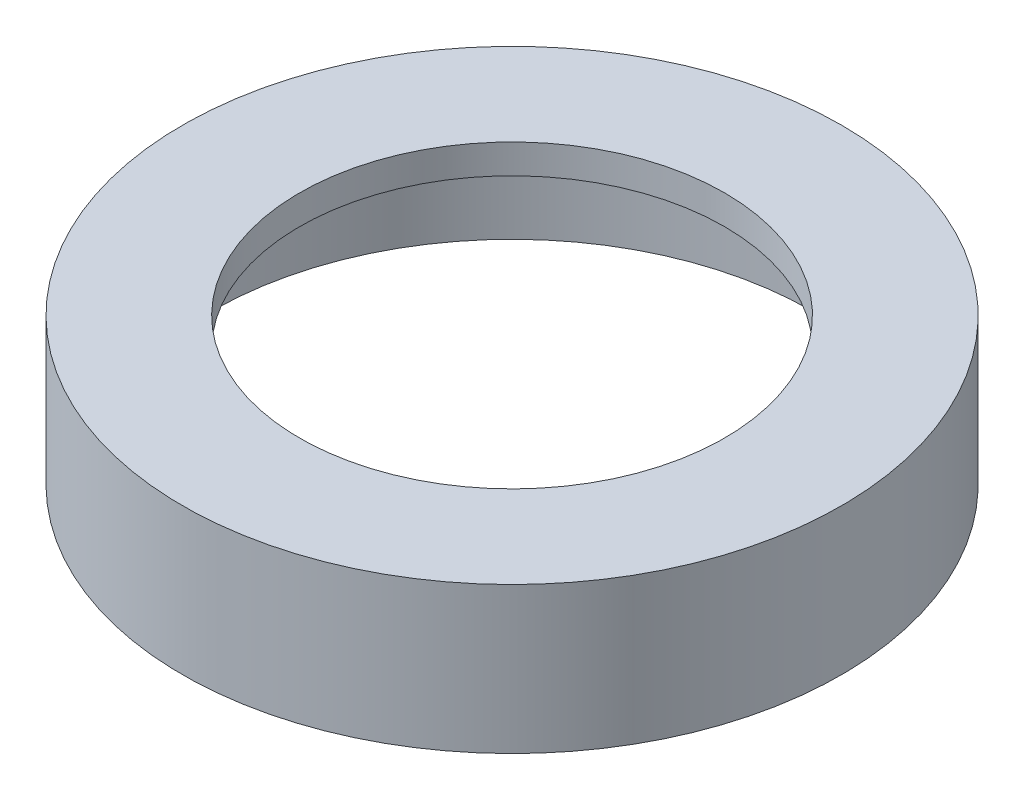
from build123d import *


with BuildPart() as part:
    # Sketch1 → Revolve1 (revolve)
    with BuildSketch(Plane.XY, mode=Mode.PRIVATE) as revolve1_sk:
        Polygon((-32.5628, 120.65), (-32.5628, 133.35), (-23.0378, 133.35), (-23.0378, 136.525), (-35.7378, 136.525), (-35.7378, 120.65), align=None)
    revolve(revolve1_sk.sketch.rotate(Axis((0, 0, 0), (0, 1, 0)), 270), axis=Axis((0, 0, 0), (0, 1, 0)))


solid = part.part
